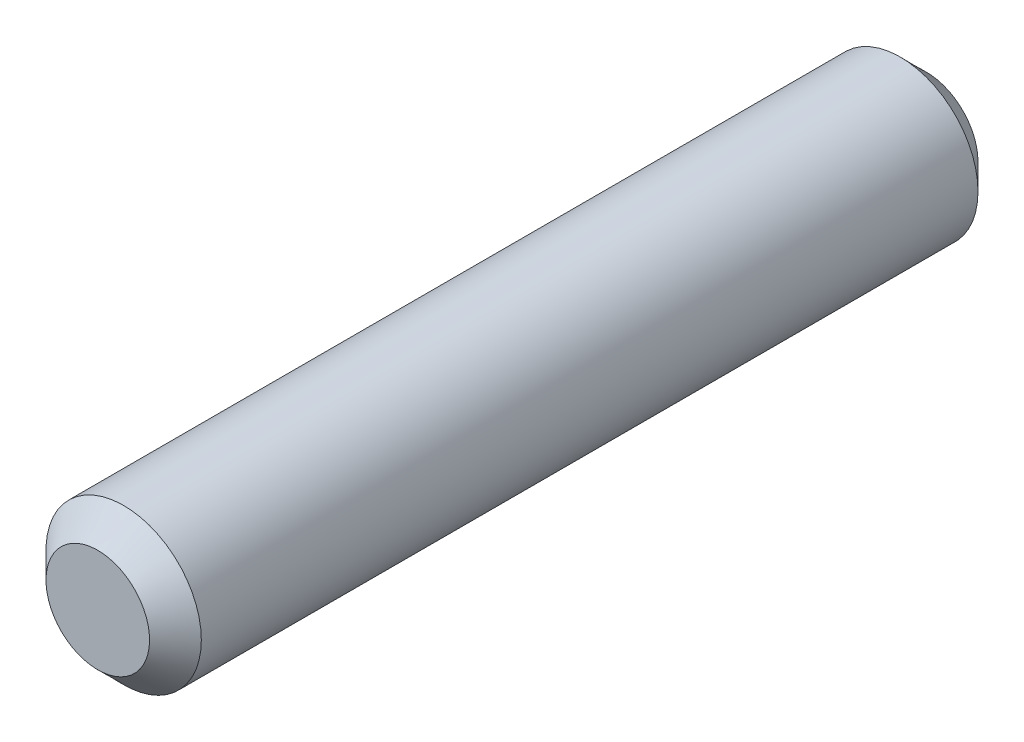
from build123d import *

# Parameters (mm, degrees)
ESQUISSE1_R        = 1.5
BOSS_EXTRU_1_DEPTH = 8
CHANFREIN1_SIZE    = 0.5


with BuildPart() as part:
    # Esquisse1 → Boss.-Extru.1 (new, symmetric)
    with BuildSketch(Plane.XY):
        Circle(ESQUISSE1_R)
    extrude(amount=BOSS_EXTRU_1_DEPTH, both=True)

    # Chanfrein1
    chanfrein1_edges = [part.edges().sort_by_distance(p)[0] for p in [
        (-1.5, 0, -8),
        (-1.5, 0, 8),
    ]]
    chamfer(chanfrein1_edges, length=CHANFREIN1_SIZE)


solid = part.part
